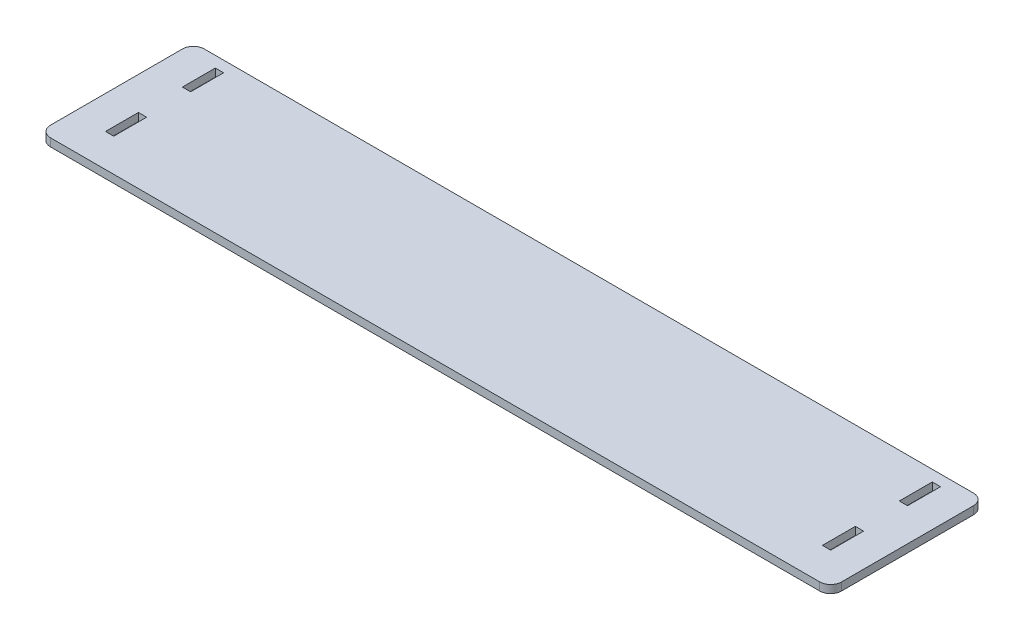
ISO-10303-21;
HEADER;
FILE_DESCRIPTION(('STEP AP214'),'2;1');
FILE_NAME('part.step','',(''),(''),'','','');
FILE_SCHEMA(('AUTOMOTIVE_DESIGN { 1 0 10303 214 1 1 1 1 }'));
ENDSEC;
DATA;
#1=APPLICATION_CONTEXT('core data for automotive mechanical design processes');
#2=APPLICATION_PROTOCOL_DEFINITION('international standard','automotive_design',2000,#1);
#3=PRODUCT_CONTEXT('',#1,'mechanical');
#4=PRODUCT('Part','Part','',(#3));
#5=PRODUCT_RELATED_PRODUCT_CATEGORY('part','',(#4));
#6=PRODUCT_DEFINITION_FORMATION('','',#4);
#7=PRODUCT_DEFINITION_CONTEXT('part definition',#1,'design');
#8=PRODUCT_DEFINITION('design','',#6,#7);
#9=PRODUCT_DEFINITION_SHAPE('','',#8);
#10=(LENGTH_UNIT() NAMED_UNIT(*) SI_UNIT(.MILLI.,.METRE.));
#11=(NAMED_UNIT(*) PLANE_ANGLE_UNIT() SI_UNIT($,.RADIAN.));
#12=(NAMED_UNIT(*) SI_UNIT($,.STERADIAN.) SOLID_ANGLE_UNIT());
#13=UNCERTAINTY_MEASURE_WITH_UNIT(LENGTH_MEASURE(1.E-05),#10,'distance_accuracy_value','');
#14=(GEOMETRIC_REPRESENTATION_CONTEXT(3) GLOBAL_UNCERTAINTY_ASSIGNED_CONTEXT((#13)) GLOBAL_UNIT_ASSIGNED_CONTEXT((#10,
#11,#12)) REPRESENTATION_CONTEXT('',''));
#15=CARTESIAN_POINT('',(0.,0.,0.));
#16=DIRECTION('',(0.,0.,1.));
#17=DIRECTION('',(1.,0.,0.));
#18=AXIS2_PLACEMENT_3D('',#15,#16,#17);
#19=CARTESIAN_POINT('',(0.,18.288,0.));
#20=DIRECTION('',(0.,1.,0.));
#21=DIRECTION('',(0.,0.,1.));
#22=AXIS2_PLACEMENT_3D('',#19,#20,#21);
#23=PLANE('',#22);
#24=DIRECTION('',(1.,0.,0.));
#25=VECTOR('',#24,1.);
#26=CARTESIAN_POINT('',(838.2,18.288,-152.4));
#27=LINE('',#26,#25);
#28=CARTESIAN_POINT('',(819.15,18.288,-152.4));
#29=VERTEX_POINT('',#28);
#30=CARTESIAN_POINT('',(838.2,18.288,-152.4));
#31=VERTEX_POINT('',#30);
#32=EDGE_CURVE('E240',#29,#31,#27,.T.);
#33=ORIENTED_EDGE('',*,*,#32,.T.);
#34=DIRECTION('',(0.,0.,1.));
#35=VECTOR('',#34,1.);
#36=CARTESIAN_POINT('',(838.2,18.288,-152.4));
#37=LINE('',#36,#35);
#38=CARTESIAN_POINT('',(838.2,18.288,-76.2000000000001));
#39=VERTEX_POINT('',#38);
#40=EDGE_CURVE('E223',#31,#39,#37,.T.);
#41=ORIENTED_EDGE('',*,*,#40,.T.);
#42=DIRECTION('',(-1.,0.,0.));
#43=VECTOR('',#42,1.);
#44=CARTESIAN_POINT('',(838.2,18.288,-76.2000000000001));
#45=LINE('',#44,#43);
#46=CARTESIAN_POINT('',(819.15,18.288,-76.2000000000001));
#47=VERTEX_POINT('',#46);
#48=EDGE_CURVE('E230',#39,#47,#45,.T.);
#49=ORIENTED_EDGE('',*,*,#48,.T.);
#50=DIRECTION('',(0.,0.,-1.));
#51=VECTOR('',#50,1.);
#52=CARTESIAN_POINT('',(819.15,18.288,-152.4));
#53=LINE('',#52,#51);
#54=EDGE_CURVE('E243',#47,#29,#53,.T.);
#55=ORIENTED_EDGE('',*,*,#54,.T.);
#56=EDGE_LOOP('',(#33,#41,#49,#55));
#57=FACE_BOUND('',#56,.T.);
#58=DIRECTION('',(0.,0.,1.));
#59=VECTOR('',#58,1.);
#60=CARTESIAN_POINT('',(-838.2,18.288,25.4000000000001));
#61=LINE('',#60,#59);
#62=CARTESIAN_POINT('',(-838.2,18.288,25.4000000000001));
#63=VERTEX_POINT('',#62);
#64=CARTESIAN_POINT('',(-838.2,18.288,101.6));
#65=VERTEX_POINT('',#64);
#66=EDGE_CURVE('E251',#63,#65,#61,.T.);
#67=ORIENTED_EDGE('',*,*,#66,.F.);
#68=DIRECTION('',(-1.,0.,0.));
#69=VECTOR('',#68,1.);
#70=CARTESIAN_POINT('',(-838.2,18.288,25.4000000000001));
#71=LINE('',#70,#69);
#72=CARTESIAN_POINT('',(-819.15,18.288,25.4000000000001));
#73=VERTEX_POINT('',#72);
#74=EDGE_CURVE('E262',#73,#63,#71,.T.);
#75=ORIENTED_EDGE('',*,*,#74,.F.);
#76=DIRECTION('',(0.,0.,-1.));
#77=VECTOR('',#76,1.);
#78=CARTESIAN_POINT('',(-819.15,18.288,25.4000000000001));
#79=LINE('',#78,#77);
#80=CARTESIAN_POINT('',(-819.15,18.288,101.6));
#81=VERTEX_POINT('',#80);
#82=EDGE_CURVE('E276',#81,#73,#79,.T.);
#83=ORIENTED_EDGE('',*,*,#82,.F.);
#84=DIRECTION('',(1.,0.,0.));
#85=VECTOR('',#84,1.);
#86=CARTESIAN_POINT('',(-838.2,18.288,101.6));
#87=LINE('',#86,#85);
#88=EDGE_CURVE('E273',#65,#81,#87,.T.);
#89=ORIENTED_EDGE('',*,*,#88,.F.);
#90=EDGE_LOOP('',(#67,#75,#83,#89));
#91=FACE_BOUND('',#90,.T.);
#92=DIRECTION('',(0.,0.,1.));
#93=VECTOR('',#92,1.);
#94=CARTESIAN_POINT('',(-838.2,18.288,-152.4));
#95=LINE('',#94,#93);
#96=CARTESIAN_POINT('',(-838.2,18.288,-152.4));
#97=VERTEX_POINT('',#96);
#98=CARTESIAN_POINT('',(-838.2,18.288,-76.2000000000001));
#99=VERTEX_POINT('',#98);
#100=EDGE_CURVE('E283',#97,#99,#95,.T.);
#101=ORIENTED_EDGE('',*,*,#100,.F.);
#102=DIRECTION('',(-1.,0.,0.));
#103=VECTOR('',#102,1.);
#104=CARTESIAN_POINT('',(-838.2,18.288,-152.4));
#105=LINE('',#104,#103);
#106=CARTESIAN_POINT('',(-819.15,18.288,-152.4));
#107=VERTEX_POINT('',#106);
#108=EDGE_CURVE('E294',#107,#97,#105,.T.);
#109=ORIENTED_EDGE('',*,*,#108,.F.);
#110=DIRECTION('',(0.,0.,-1.));
#111=VECTOR('',#110,1.);
#112=CARTESIAN_POINT('',(-819.15,18.288,-152.4));
#113=LINE('',#112,#111);
#114=CARTESIAN_POINT('',(-819.15,18.288,-76.2000000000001));
#115=VERTEX_POINT('',#114);
#116=EDGE_CURVE('E308',#115,#107,#113,.T.);
#117=ORIENTED_EDGE('',*,*,#116,.F.);
#118=DIRECTION('',(1.,0.,0.));
#119=VECTOR('',#118,1.);
#120=CARTESIAN_POINT('',(-838.2,18.288,-76.2000000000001));
#121=LINE('',#120,#119);
#122=EDGE_CURVE('E305',#99,#115,#121,.T.);
#123=ORIENTED_EDGE('',*,*,#122,.F.);
#124=EDGE_LOOP('',(#101,#109,#117,#123));
#125=FACE_BOUND('',#124,.T.);
#126=DIRECTION('',(-1.,0.,0.));
#127=VECTOR('',#126,1.);
#128=CARTESIAN_POINT('',(914.4,18.288,-177.8));
#129=LINE('',#128,#127);
#130=CARTESIAN_POINT('',(889.,18.288,-177.8));
#131=VERTEX_POINT('',#130);
#132=CARTESIAN_POINT('',(-889.,18.288,-177.8));
#133=VERTEX_POINT('',#132);
#134=EDGE_CURVE('E332',#131,#133,#129,.T.);
#135=ORIENTED_EDGE('',*,*,#134,.T.);
#136=CARTESIAN_POINT('',(-889.,18.288,-152.4));
#137=DIRECTION('',(0.,1.,0.));
#138=DIRECTION('',(0.,0.,1.));
#139=AXIS2_PLACEMENT_3D('',#136,#137,#138);
#140=CIRCLE('',#139,25.4);
#141=CARTESIAN_POINT('',(-914.4,18.288,-152.4));
#142=VERTEX_POINT('',#141);
#143=EDGE_CURVE('E369',#133,#142,#140,.T.);
#144=ORIENTED_EDGE('',*,*,#143,.T.);
#145=DIRECTION('',(0.,0.,1.));
#146=VECTOR('',#145,1.);
#147=CARTESIAN_POINT('',(-914.4,18.288,177.8));
#148=LINE('',#147,#146);
#149=CARTESIAN_POINT('',(-914.4,18.288,152.4));
#150=VERTEX_POINT('',#149);
#151=EDGE_CURVE('E322',#142,#150,#148,.T.);
#152=ORIENTED_EDGE('',*,*,#151,.T.);
#153=CARTESIAN_POINT('',(-889.,18.288,152.4));
#154=DIRECTION('',(0.,1.,0.));
#155=DIRECTION('',(0.,0.,1.));
#156=AXIS2_PLACEMENT_3D('',#153,#154,#155);
#157=CIRCLE('',#156,25.4);
#158=CARTESIAN_POINT('',(-889.,18.288,177.8));
#159=VERTEX_POINT('',#158);
#160=EDGE_CURVE('E367',#150,#159,#157,.T.);
#161=ORIENTED_EDGE('',*,*,#160,.T.);
#162=DIRECTION('',(1.,0.,0.));
#163=VECTOR('',#162,1.);
#164=CARTESIAN_POINT('',(914.4,18.288,177.8));
#165=LINE('',#164,#163);
#166=CARTESIAN_POINT('',(889.,18.288,177.8));
#167=VERTEX_POINT('',#166);
#168=EDGE_CURVE('E325',#159,#167,#165,.T.);
#169=ORIENTED_EDGE('',*,*,#168,.T.);
#170=CARTESIAN_POINT('',(889.,18.288,152.4));
#171=DIRECTION('',(0.,1.,0.));
#172=DIRECTION('',(0.,0.,1.));
#173=AXIS2_PLACEMENT_3D('',#170,#171,#172);
#174=CIRCLE('',#173,25.4);
#175=CARTESIAN_POINT('',(914.4,18.288,152.4));
#176=VERTEX_POINT('',#175);
#177=EDGE_CURVE('E363',#167,#176,#174,.T.);
#178=ORIENTED_EDGE('',*,*,#177,.T.);
#179=DIRECTION('',(0.,0.,-1.));
#180=VECTOR('',#179,1.);
#181=CARTESIAN_POINT('',(914.4,18.288,177.8));
#182=LINE('',#181,#180);
#183=CARTESIAN_POINT('',(914.4,18.288,-152.4));
#184=VERTEX_POINT('',#183);
#185=EDGE_CURVE('E329',#176,#184,#182,.T.);
#186=ORIENTED_EDGE('',*,*,#185,.T.);
#187=CARTESIAN_POINT('',(889.,18.288,-152.4));
#188=DIRECTION('',(0.,1.,0.));
#189=DIRECTION('',(0.,0.,1.));
#190=AXIS2_PLACEMENT_3D('',#187,#188,#189);
#191=CIRCLE('',#190,25.4);
#192=EDGE_CURVE('E365',#184,#131,#191,.T.);
#193=ORIENTED_EDGE('',*,*,#192,.T.);
#194=EDGE_LOOP('',(#135,#144,#152,#161,#169,#178,#186,#193));
#195=FACE_BOUND('',#194,.T.);
#196=DIRECTION('',(1.,0.,0.));
#197=VECTOR('',#196,1.);
#198=CARTESIAN_POINT('',(838.2,18.288,25.4000000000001));
#199=LINE('',#198,#197);
#200=CARTESIAN_POINT('',(819.15,18.288,25.4000000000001));
#201=VERTEX_POINT('',#200);
#202=CARTESIAN_POINT('',(838.2,18.288,25.4000000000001));
#203=VERTEX_POINT('',#202);
#204=EDGE_CURVE('E217',#201,#203,#199,.T.);
#205=ORIENTED_EDGE('',*,*,#204,.T.);
#206=DIRECTION('',(0.,0.,1.));
#207=VECTOR('',#206,1.);
#208=CARTESIAN_POINT('',(838.2,18.288,25.4000000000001));
#209=LINE('',#208,#207);
#210=CARTESIAN_POINT('',(838.2,18.288,101.6));
#211=VERTEX_POINT('',#210);
#212=EDGE_CURVE('E47',#203,#211,#209,.T.);
#213=ORIENTED_EDGE('',*,*,#212,.T.);
#214=DIRECTION('',(-1.,0.,0.));
#215=VECTOR('',#214,1.);
#216=CARTESIAN_POINT('',(838.2,18.288,101.6));
#217=LINE('',#216,#215);
#218=CARTESIAN_POINT('',(819.15,18.288,101.6));
#219=VERTEX_POINT('',#218);
#220=EDGE_CURVE('E208',#211,#219,#217,.T.);
#221=ORIENTED_EDGE('',*,*,#220,.T.);
#222=DIRECTION('',(0.,0.,-1.));
#223=VECTOR('',#222,1.);
#224=CARTESIAN_POINT('',(819.15,18.288,25.4000000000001));
#225=LINE('',#224,#223);
#226=EDGE_CURVE('E211',#219,#201,#225,.T.);
#227=ORIENTED_EDGE('',*,*,#226,.T.);
#228=EDGE_LOOP('',(#205,#213,#221,#227));
#229=FACE_BOUND('',#228,.T.);
#230=ADVANCED_FACE('F32',(#57,#91,#125,#195,#229),#23,.T.);
#231=CARTESIAN_POINT('',(0.,0.,0.));
#232=DIRECTION('',(0.,1.,0.));
#233=DIRECTION('',(0.,0.,1.));
#234=AXIS2_PLACEMENT_3D('',#231,#232,#233);
#235=PLANE('',#234);
#236=DIRECTION('',(0.,0.,1.));
#237=VECTOR('',#236,1.);
#238=CARTESIAN_POINT('',(838.2,0.,-152.4));
#239=LINE('',#238,#237);
#240=CARTESIAN_POINT('',(838.2,0.,-152.4));
#241=VERTEX_POINT('',#240);
#242=CARTESIAN_POINT('',(838.2,0.,-76.2000000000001));
#243=VERTEX_POINT('',#242);
#244=EDGE_CURVE('E227',#241,#243,#239,.T.);
#245=ORIENTED_EDGE('',*,*,#244,.F.);
#246=DIRECTION('',(1.,0.,0.));
#247=VECTOR('',#246,1.);
#248=CARTESIAN_POINT('',(838.2,0.,-152.4));
#249=LINE('',#248,#247);
#250=CARTESIAN_POINT('',(819.15,0.,-152.4));
#251=VERTEX_POINT('',#250);
#252=EDGE_CURVE('E229',#251,#241,#249,.T.);
#253=ORIENTED_EDGE('',*,*,#252,.F.);
#254=DIRECTION('',(0.,0.,-1.));
#255=VECTOR('',#254,1.);
#256=CARTESIAN_POINT('',(819.15,0.,-152.4));
#257=LINE('',#256,#255);
#258=CARTESIAN_POINT('',(819.15,0.,-76.2000000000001));
#259=VERTEX_POINT('',#258);
#260=EDGE_CURVE('E232',#259,#251,#257,.T.);
#261=ORIENTED_EDGE('',*,*,#260,.F.);
#262=DIRECTION('',(-1.,0.,0.));
#263=VECTOR('',#262,1.);
#264=CARTESIAN_POINT('',(838.2,0.,-76.2000000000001));
#265=LINE('',#264,#263);
#266=EDGE_CURVE('E235',#243,#259,#265,.T.);
#267=ORIENTED_EDGE('',*,*,#266,.F.);
#268=EDGE_LOOP('',(#245,#253,#261,#267));
#269=FACE_BOUND('',#268,.T.);
#270=DIRECTION('',(-1.,0.,0.));
#271=VECTOR('',#270,1.);
#272=CARTESIAN_POINT('',(-838.2,0.,25.4000000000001));
#273=LINE('',#272,#271);
#274=CARTESIAN_POINT('',(-819.15,0.,25.4000000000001));
#275=VERTEX_POINT('',#274);
#276=CARTESIAN_POINT('',(-838.2,0.,25.4000000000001));
#277=VERTEX_POINT('',#276);
#278=EDGE_CURVE('E268',#275,#277,#273,.T.);
#279=ORIENTED_EDGE('',*,*,#278,.T.);
#280=DIRECTION('',(0.,0.,1.));
#281=VECTOR('',#280,1.);
#282=CARTESIAN_POINT('',(-838.2,0.,25.4000000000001));
#283=LINE('',#282,#281);
#284=CARTESIAN_POINT('',(-838.2,0.,101.6));
#285=VERTEX_POINT('',#284);
#286=EDGE_CURVE('E258',#277,#285,#283,.T.);
#287=ORIENTED_EDGE('',*,*,#286,.T.);
#288=DIRECTION('',(1.,0.,0.));
#289=VECTOR('',#288,1.);
#290=CARTESIAN_POINT('',(-838.2,0.,101.6));
#291=LINE('',#290,#289);
#292=CARTESIAN_POINT('',(-819.15,0.,101.6));
#293=VERTEX_POINT('',#292);
#294=EDGE_CURVE('E261',#285,#293,#291,.T.);
#295=ORIENTED_EDGE('',*,*,#294,.T.);
#296=DIRECTION('',(0.,0.,-1.));
#297=VECTOR('',#296,1.);
#298=CARTESIAN_POINT('',(-819.15,0.,25.4000000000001));
#299=LINE('',#298,#297);
#300=EDGE_CURVE('E265',#293,#275,#299,.T.);
#301=ORIENTED_EDGE('',*,*,#300,.T.);
#302=EDGE_LOOP('',(#279,#287,#295,#301));
#303=FACE_BOUND('',#302,.T.);
#304=DIRECTION('',(-1.,0.,0.));
#305=VECTOR('',#304,1.);
#306=CARTESIAN_POINT('',(-838.2,0.,-152.4));
#307=LINE('',#306,#305);
#308=CARTESIAN_POINT('',(-819.15,0.,-152.4));
#309=VERTEX_POINT('',#308);
#310=CARTESIAN_POINT('',(-838.2,0.,-152.4));
#311=VERTEX_POINT('',#310);
#312=EDGE_CURVE('E300',#309,#311,#307,.T.);
#313=ORIENTED_EDGE('',*,*,#312,.T.);
#314=DIRECTION('',(0.,0.,1.));
#315=VECTOR('',#314,1.);
#316=CARTESIAN_POINT('',(-838.2,0.,-152.4));
#317=LINE('',#316,#315);
#318=CARTESIAN_POINT('',(-838.2,0.,-76.2000000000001));
#319=VERTEX_POINT('',#318);
#320=EDGE_CURVE('E290',#311,#319,#317,.T.);
#321=ORIENTED_EDGE('',*,*,#320,.T.);
#322=DIRECTION('',(1.,0.,0.));
#323=VECTOR('',#322,1.);
#324=CARTESIAN_POINT('',(-838.2,0.,-76.2000000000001));
#325=LINE('',#324,#323);
#326=CARTESIAN_POINT('',(-819.15,0.,-76.2000000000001));
#327=VERTEX_POINT('',#326);
#328=EDGE_CURVE('E293',#319,#327,#325,.T.);
#329=ORIENTED_EDGE('',*,*,#328,.T.);
#330=DIRECTION('',(0.,0.,-1.));
#331=VECTOR('',#330,1.);
#332=CARTESIAN_POINT('',(-819.15,0.,-152.4));
#333=LINE('',#332,#331);
#334=EDGE_CURVE('E297',#327,#309,#333,.T.);
#335=ORIENTED_EDGE('',*,*,#334,.T.);
#336=EDGE_LOOP('',(#313,#321,#329,#335));
#337=FACE_BOUND('',#336,.T.);
#338=DIRECTION('',(0.,0.,1.));
#339=VECTOR('',#338,1.);
#340=CARTESIAN_POINT('',(-914.4,0.,177.8));
#341=LINE('',#340,#339);
#342=CARTESIAN_POINT('',(-914.4,0.,-152.4));
#343=VERTEX_POINT('',#342);
#344=CARTESIAN_POINT('',(-914.4,0.,152.4));
#345=VERTEX_POINT('',#344);
#346=EDGE_CURVE('E315',#343,#345,#341,.T.);
#347=ORIENTED_EDGE('',*,*,#346,.F.);
#348=CARTESIAN_POINT('',(-889.,0.,-152.4));
#349=DIRECTION('',(0.,1.,0.));
#350=DIRECTION('',(0.,0.,1.));
#351=AXIS2_PLACEMENT_3D('',#348,#349,#350);
#352=CIRCLE('',#351,25.4);
#353=CARTESIAN_POINT('',(-889.,0.,-177.8));
#354=VERTEX_POINT('',#353);
#355=EDGE_CURVE('E356',#343,#354,#352,.F.);
#356=ORIENTED_EDGE('',*,*,#355,.T.);
#357=DIRECTION('',(-1.,0.,0.));
#358=VECTOR('',#357,1.);
#359=CARTESIAN_POINT('',(914.4,0.,-177.8));
#360=LINE('',#359,#358);
#361=CARTESIAN_POINT('',(889.,0.,-177.8));
#362=VERTEX_POINT('',#361);
#363=EDGE_CURVE('E326',#362,#354,#360,.T.);
#364=ORIENTED_EDGE('',*,*,#363,.F.);
#365=CARTESIAN_POINT('',(889.,0.,-152.4));
#366=DIRECTION('',(0.,1.,0.));
#367=DIRECTION('',(0.,0.,1.));
#368=AXIS2_PLACEMENT_3D('',#365,#366,#367);
#369=CIRCLE('',#368,25.4);
#370=CARTESIAN_POINT('',(914.4,0.,-152.4));
#371=VERTEX_POINT('',#370);
#372=EDGE_CURVE('E352',#362,#371,#369,.F.);
#373=ORIENTED_EDGE('',*,*,#372,.T.);
#374=DIRECTION('',(0.,0.,-1.));
#375=VECTOR('',#374,1.);
#376=CARTESIAN_POINT('',(914.4,0.,177.8));
#377=LINE('',#376,#375);
#378=CARTESIAN_POINT('',(914.4,0.,152.4));
#379=VERTEX_POINT('',#378);
#380=EDGE_CURVE('E341',#379,#371,#377,.T.);
#381=ORIENTED_EDGE('',*,*,#380,.F.);
#382=CARTESIAN_POINT('',(889.,0.,152.4));
#383=DIRECTION('',(0.,1.,0.));
#384=DIRECTION('',(0.,0.,1.));
#385=AXIS2_PLACEMENT_3D('',#382,#383,#384);
#386=CIRCLE('',#385,25.4);
#387=CARTESIAN_POINT('',(889.,0.,177.8));
#388=VERTEX_POINT('',#387);
#389=EDGE_CURVE('E350',#379,#388,#386,.F.);
#390=ORIENTED_EDGE('',*,*,#389,.T.);
#391=DIRECTION('',(1.,0.,0.));
#392=VECTOR('',#391,1.);
#393=CARTESIAN_POINT('',(914.4,0.,177.8));
#394=LINE('',#393,#392);
#395=CARTESIAN_POINT('',(-889.,0.,177.8));
#396=VERTEX_POINT('',#395);
#397=EDGE_CURVE('E338',#396,#388,#394,.T.);
#398=ORIENTED_EDGE('',*,*,#397,.F.);
#399=CARTESIAN_POINT('',(-889.,0.,152.4));
#400=DIRECTION('',(0.,1.,0.));
#401=DIRECTION('',(0.,0.,1.));
#402=AXIS2_PLACEMENT_3D('',#399,#400,#401);
#403=CIRCLE('',#402,25.4);
#404=EDGE_CURVE('E354',#396,#345,#403,.F.);
#405=ORIENTED_EDGE('',*,*,#404,.T.);
#406=EDGE_LOOP('',(#347,#356,#364,#373,#381,#390,#398,#405));
#407=FACE_BOUND('',#406,.T.);
#408=DIRECTION('',(0.,0.,1.));
#409=VECTOR('',#408,1.);
#410=CARTESIAN_POINT('',(838.2,0.,25.4000000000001));
#411=LINE('',#410,#409);
#412=CARTESIAN_POINT('',(838.2,0.,25.4000000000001));
#413=VERTEX_POINT('',#412);
#414=CARTESIAN_POINT('',(838.2,0.,101.6));
#415=VERTEX_POINT('',#414);
#416=EDGE_CURVE('E200',#413,#415,#411,.T.);
#417=ORIENTED_EDGE('',*,*,#416,.F.);
#418=DIRECTION('',(1.,0.,0.));
#419=VECTOR('',#418,1.);
#420=CARTESIAN_POINT('',(838.2,0.,25.4000000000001));
#421=LINE('',#420,#419);
#422=CARTESIAN_POINT('',(819.15,0.,25.4000000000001));
#423=VERTEX_POINT('',#422);
#424=EDGE_CURVE('E192',#423,#413,#421,.T.);
#425=ORIENTED_EDGE('',*,*,#424,.F.);
#426=DIRECTION('',(0.,0.,-1.));
#427=VECTOR('',#426,1.);
#428=CARTESIAN_POINT('',(819.15,0.,25.4000000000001));
#429=LINE('',#428,#427);
#430=CARTESIAN_POINT('',(819.15,0.,101.6));
#431=VERTEX_POINT('',#430);
#432=EDGE_CURVE('E199',#431,#423,#429,.T.);
#433=ORIENTED_EDGE('',*,*,#432,.F.);
#434=DIRECTION('',(-1.,0.,0.));
#435=VECTOR('',#434,1.);
#436=CARTESIAN_POINT('',(838.2,0.,101.6));
#437=LINE('',#436,#435);
#438=EDGE_CURVE('E204',#415,#431,#437,.T.);
#439=ORIENTED_EDGE('',*,*,#438,.F.);
#440=EDGE_LOOP('',(#417,#425,#433,#439));
#441=FACE_BOUND('',#440,.T.);
#442=ADVANCED_FACE('F207',(#269,#303,#337,#407,#441),#235,.F.);
#443=CARTESIAN_POINT('',(-914.4,18.288,177.8));
#444=DIRECTION('',(1.,0.,0.));
#445=DIRECTION('',(0.,0.,-1.));
#446=AXIS2_PLACEMENT_3D('',#443,#444,#445);
#447=PLANE('',#446);
#448=ORIENTED_EDGE('',*,*,#151,.F.);
#449=DIRECTION('',(0.,-1.,0.));
#450=VECTOR('',#449,1.);
#451=CARTESIAN_POINT('',(-914.4,18.288,-152.4));
#452=LINE('',#451,#450);
#453=EDGE_CURVE('E347',#142,#343,#452,.T.);
#454=ORIENTED_EDGE('',*,*,#453,.T.);
#455=ORIENTED_EDGE('',*,*,#346,.T.);
#456=DIRECTION('',(0.,-1.,0.));
#457=VECTOR('',#456,1.);
#458=CARTESIAN_POINT('',(-914.4,18.288,152.4));
#459=LINE('',#458,#457);
#460=EDGE_CURVE('E335',#345,#150,#459,.F.);
#461=ORIENTED_EDGE('',*,*,#460,.T.);
#462=EDGE_LOOP('',(#448,#454,#455,#461));
#463=FACE_BOUND('',#462,.T.);
#464=ADVANCED_FACE('F404',(#463),#447,.F.);
#465=CARTESIAN_POINT('',(914.4,18.288,177.8));
#466=DIRECTION('',(0.,0.,-1.));
#467=DIRECTION('',(-1.,0.,0.));
#468=AXIS2_PLACEMENT_3D('',#465,#466,#467);
#469=PLANE('',#468);
#470=ORIENTED_EDGE('',*,*,#168,.F.);
#471=DIRECTION('',(0.,-1.,0.));
#472=VECTOR('',#471,1.);
#473=CARTESIAN_POINT('',(-889.,18.288,177.8));
#474=LINE('',#473,#472);
#475=EDGE_CURVE('E373',#159,#396,#474,.T.);
#476=ORIENTED_EDGE('',*,*,#475,.T.);
#477=ORIENTED_EDGE('',*,*,#397,.T.);
#478=DIRECTION('',(0.,-1.,0.));
#479=VECTOR('',#478,1.);
#480=CARTESIAN_POINT('',(889.,18.288,177.8));
#481=LINE('',#480,#479);
#482=EDGE_CURVE('E371',#388,#167,#481,.F.);
#483=ORIENTED_EDGE('',*,*,#482,.T.);
#484=EDGE_LOOP('',(#470,#476,#477,#483));
#485=FACE_BOUND('',#484,.T.);
#486=ADVANCED_FACE('F412',(#485),#469,.F.);
#487=CARTESIAN_POINT('',(914.4,18.288,177.8));
#488=DIRECTION('',(-1.,0.,0.));
#489=DIRECTION('',(0.,0.,1.));
#490=AXIS2_PLACEMENT_3D('',#487,#488,#489);
#491=PLANE('',#490);
#492=ORIENTED_EDGE('',*,*,#380,.T.);
#493=DIRECTION('',(0.,-1.,0.));
#494=VECTOR('',#493,1.);
#495=CARTESIAN_POINT('',(914.4,18.288,-152.4));
#496=LINE('',#495,#494);
#497=EDGE_CURVE('E11',#371,#184,#496,.F.);
#498=ORIENTED_EDGE('',*,*,#497,.T.);
#499=ORIENTED_EDGE('',*,*,#185,.F.);
#500=DIRECTION('',(0.,-1.,0.));
#501=VECTOR('',#500,1.);
#502=CARTESIAN_POINT('',(914.4,18.288,152.4));
#503=LINE('',#502,#501);
#504=EDGE_CURVE('E40',#176,#379,#503,.T.);
#505=ORIENTED_EDGE('',*,*,#504,.T.);
#506=EDGE_LOOP('',(#492,#498,#499,#505));
#507=FACE_BOUND('',#506,.T.);
#508=ADVANCED_FACE('F380',(#507),#491,.F.);
#509=CARTESIAN_POINT('',(914.4,18.288,-177.8));
#510=DIRECTION('',(0.,0.,1.));
#511=DIRECTION('',(1.,0.,0.));
#512=AXIS2_PLACEMENT_3D('',#509,#510,#511);
#513=PLANE('',#512);
#514=ORIENTED_EDGE('',*,*,#363,.T.);
#515=DIRECTION('',(0.,-1.,0.));
#516=VECTOR('',#515,1.);
#517=CARTESIAN_POINT('',(-889.,18.288,-177.8));
#518=LINE('',#517,#516);
#519=EDGE_CURVE('E361',#354,#133,#518,.F.);
#520=ORIENTED_EDGE('',*,*,#519,.T.);
#521=ORIENTED_EDGE('',*,*,#134,.F.);
#522=DIRECTION('',(0.,-1.,0.));
#523=VECTOR('',#522,1.);
#524=CARTESIAN_POINT('',(889.,18.288,-177.8));
#525=LINE('',#524,#523);
#526=EDGE_CURVE('E358',#131,#362,#525,.T.);
#527=ORIENTED_EDGE('',*,*,#526,.T.);
#528=EDGE_LOOP('',(#514,#520,#521,#527));
#529=FACE_BOUND('',#528,.T.);
#530=ADVANCED_FACE('F394',(#529),#513,.F.);
#531=CARTESIAN_POINT('',(-889.,18.288,-152.4));
#532=DIRECTION('',(0.,-1.,0.));
#533=DIRECTION('',(0.,0.,-1.));
#534=AXIS2_PLACEMENT_3D('',#531,#532,#533);
#535=CYLINDRICAL_SURFACE('',#534,25.4);
#536=ORIENTED_EDGE('',*,*,#143,.F.);
#537=ORIENTED_EDGE('',*,*,#519,.F.);
#538=ORIENTED_EDGE('',*,*,#355,.F.);
#539=ORIENTED_EDGE('',*,*,#453,.F.);
#540=EDGE_LOOP('',(#536,#537,#538,#539));
#541=FACE_BOUND('',#540,.T.);
#542=ADVANCED_FACE('F402',(#541),#535,.T.);
#543=CARTESIAN_POINT('',(-889.,18.288,152.4));
#544=DIRECTION('',(0.,-1.,0.));
#545=DIRECTION('',(0.,0.,-1.));
#546=AXIS2_PLACEMENT_3D('',#543,#544,#545);
#547=CYLINDRICAL_SURFACE('',#546,25.4);
#548=ORIENTED_EDGE('',*,*,#160,.F.);
#549=ORIENTED_EDGE('',*,*,#460,.F.);
#550=ORIENTED_EDGE('',*,*,#404,.F.);
#551=ORIENTED_EDGE('',*,*,#475,.F.);
#552=EDGE_LOOP('',(#548,#549,#550,#551));
#553=FACE_BOUND('',#552,.T.);
#554=ADVANCED_FACE('F409',(#553),#547,.T.);
#555=CARTESIAN_POINT('',(889.,18.288,-152.4));
#556=DIRECTION('',(0.,-1.,0.));
#557=DIRECTION('',(0.,0.,-1.));
#558=AXIS2_PLACEMENT_3D('',#555,#556,#557);
#559=CYLINDRICAL_SURFACE('',#558,25.4);
#560=ORIENTED_EDGE('',*,*,#192,.F.);
#561=ORIENTED_EDGE('',*,*,#497,.F.);
#562=ORIENTED_EDGE('',*,*,#372,.F.);
#563=ORIENTED_EDGE('',*,*,#526,.F.);
#564=EDGE_LOOP('',(#560,#561,#562,#563));
#565=FACE_BOUND('',#564,.T.);
#566=ADVANCED_FACE('F391',(#565),#559,.T.);
#567=CARTESIAN_POINT('',(889.,18.288,152.4));
#568=DIRECTION('',(0.,-1.,0.));
#569=DIRECTION('',(0.,0.,-1.));
#570=AXIS2_PLACEMENT_3D('',#567,#568,#569);
#571=CYLINDRICAL_SURFACE('',#570,25.4);
#572=ORIENTED_EDGE('',*,*,#177,.F.);
#573=ORIENTED_EDGE('',*,*,#482,.F.);
#574=ORIENTED_EDGE('',*,*,#389,.F.);
#575=ORIENTED_EDGE('',*,*,#504,.F.);
#576=EDGE_LOOP('',(#572,#573,#574,#575));
#577=FACE_BOUND('',#576,.T.);
#578=ADVANCED_FACE('F34',(#577),#571,.T.);
#579=CARTESIAN_POINT('',(-838.2,0.,-152.4));
#580=DIRECTION('',(-1.,0.,0.));
#581=DIRECTION('',(0.,0.,1.));
#582=AXIS2_PLACEMENT_3D('',#579,#580,#581);
#583=PLANE('',#582);
#584=ORIENTED_EDGE('',*,*,#100,.T.);
#585=DIRECTION('',(0.,1.,0.));
#586=VECTOR('',#585,1.);
#587=CARTESIAN_POINT('',(-838.2,0.,-76.2000000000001));
#588=LINE('',#587,#586);
#589=EDGE_CURVE('E303',#319,#99,#588,.T.);
#590=ORIENTED_EDGE('',*,*,#589,.F.);
#591=ORIENTED_EDGE('',*,*,#320,.F.);
#592=DIRECTION('',(0.,1.,0.));
#593=VECTOR('',#592,1.);
#594=CARTESIAN_POINT('',(-838.2,0.,-152.4));
#595=LINE('',#594,#593);
#596=EDGE_CURVE('E313',#311,#97,#595,.T.);
#597=ORIENTED_EDGE('',*,*,#596,.T.);
#598=EDGE_LOOP('',(#584,#590,#591,#597));
#599=FACE_BOUND('',#598,.T.);
#600=ADVANCED_FACE('F415',(#599),#583,.F.);
#601=CARTESIAN_POINT('',(-838.2,0.,-152.4));
#602=DIRECTION('',(0.,0.,-1.));
#603=DIRECTION('',(-1.,0.,0.));
#604=AXIS2_PLACEMENT_3D('',#601,#602,#603);
#605=PLANE('',#604);
#606=ORIENTED_EDGE('',*,*,#108,.T.);
#607=ORIENTED_EDGE('',*,*,#596,.F.);
#608=ORIENTED_EDGE('',*,*,#312,.F.);
#609=DIRECTION('',(0.,1.,0.));
#610=VECTOR('',#609,1.);
#611=CARTESIAN_POINT('',(-819.15,0.,-152.4));
#612=LINE('',#611,#610);
#613=EDGE_CURVE('E316',#309,#107,#612,.T.);
#614=ORIENTED_EDGE('',*,*,#613,.T.);
#615=EDGE_LOOP('',(#606,#607,#608,#614));
#616=FACE_BOUND('',#615,.T.);
#617=ADVANCED_FACE('F420',(#616),#605,.F.);
#618=CARTESIAN_POINT('',(-819.15,0.,-152.4));
#619=DIRECTION('',(1.,0.,0.));
#620=DIRECTION('',(0.,0.,-1.));
#621=AXIS2_PLACEMENT_3D('',#618,#619,#620);
#622=PLANE('',#621);
#623=ORIENTED_EDGE('',*,*,#116,.T.);
#624=ORIENTED_EDGE('',*,*,#613,.F.);
#625=ORIENTED_EDGE('',*,*,#334,.F.);
#626=DIRECTION('',(0.,1.,0.));
#627=VECTOR('',#626,1.);
#628=CARTESIAN_POINT('',(-819.15,0.,-76.2000000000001));
#629=LINE('',#628,#627);
#630=EDGE_CURVE('E318',#327,#115,#629,.T.);
#631=ORIENTED_EDGE('',*,*,#630,.T.);
#632=EDGE_LOOP('',(#623,#624,#625,#631));
#633=FACE_BOUND('',#632,.T.);
#634=ADVANCED_FACE('F472',(#633),#622,.F.);
#635=CARTESIAN_POINT('',(-838.2,0.,-76.2000000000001));
#636=DIRECTION('',(0.,0.,1.));
#637=DIRECTION('',(1.,0.,0.));
#638=AXIS2_PLACEMENT_3D('',#635,#636,#637);
#639=PLANE('',#638);
#640=ORIENTED_EDGE('',*,*,#122,.T.);
#641=ORIENTED_EDGE('',*,*,#630,.F.);
#642=ORIENTED_EDGE('',*,*,#328,.F.);
#643=ORIENTED_EDGE('',*,*,#589,.T.);
#644=EDGE_LOOP('',(#640,#641,#642,#643));
#645=FACE_BOUND('',#644,.T.);
#646=ADVANCED_FACE('F482',(#645),#639,.F.);
#647=CARTESIAN_POINT('',(-838.2,0.,25.4000000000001));
#648=DIRECTION('',(-1.,0.,0.));
#649=DIRECTION('',(0.,0.,1.));
#650=AXIS2_PLACEMENT_3D('',#647,#648,#649);
#651=PLANE('',#650);
#652=ORIENTED_EDGE('',*,*,#66,.T.);
#653=DIRECTION('',(0.,1.,0.));
#654=VECTOR('',#653,1.);
#655=CARTESIAN_POINT('',(-838.2,0.,101.6));
#656=LINE('',#655,#654);
#657=EDGE_CURVE('E271',#285,#65,#656,.T.);
#658=ORIENTED_EDGE('',*,*,#657,.F.);
#659=ORIENTED_EDGE('',*,*,#286,.F.);
#660=DIRECTION('',(0.,1.,0.));
#661=VECTOR('',#660,1.);
#662=CARTESIAN_POINT('',(-838.2,0.,25.4000000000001));
#663=LINE('',#662,#661);
#664=EDGE_CURVE('E281',#277,#63,#663,.T.);
#665=ORIENTED_EDGE('',*,*,#664,.T.);
#666=EDGE_LOOP('',(#652,#658,#659,#665));
#667=FACE_BOUND('',#666,.T.);
#668=ADVANCED_FACE('F492',(#667),#651,.F.);
#669=CARTESIAN_POINT('',(-838.2,0.,25.4000000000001));
#670=DIRECTION('',(0.,0.,-1.));
#671=DIRECTION('',(-1.,0.,0.));
#672=AXIS2_PLACEMENT_3D('',#669,#670,#671);
#673=PLANE('',#672);
#674=ORIENTED_EDGE('',*,*,#74,.T.);
#675=ORIENTED_EDGE('',*,*,#664,.F.);
#676=ORIENTED_EDGE('',*,*,#278,.F.);
#677=DIRECTION('',(0.,1.,0.));
#678=VECTOR('',#677,1.);
#679=CARTESIAN_POINT('',(-819.15,0.,25.4000000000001));
#680=LINE('',#679,#678);
#681=EDGE_CURVE('E284',#275,#73,#680,.T.);
#682=ORIENTED_EDGE('',*,*,#681,.T.);
#683=EDGE_LOOP('',(#674,#675,#676,#682));
#684=FACE_BOUND('',#683,.T.);
#685=ADVANCED_FACE('F501',(#684),#673,.F.);
#686=CARTESIAN_POINT('',(-819.15,0.,25.4000000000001));
#687=DIRECTION('',(1.,0.,0.));
#688=DIRECTION('',(0.,0.,-1.));
#689=AXIS2_PLACEMENT_3D('',#686,#687,#688);
#690=PLANE('',#689);
#691=ORIENTED_EDGE('',*,*,#82,.T.);
#692=ORIENTED_EDGE('',*,*,#681,.F.);
#693=ORIENTED_EDGE('',*,*,#300,.F.);
#694=DIRECTION('',(0.,1.,0.));
#695=VECTOR('',#694,1.);
#696=CARTESIAN_POINT('',(-819.15,0.,101.6));
#697=LINE('',#696,#695);
#698=EDGE_CURVE('E286',#293,#81,#697,.T.);
#699=ORIENTED_EDGE('',*,*,#698,.T.);
#700=EDGE_LOOP('',(#691,#692,#693,#699));
#701=FACE_BOUND('',#700,.T.);
#702=ADVANCED_FACE('F511',(#701),#690,.F.);
#703=CARTESIAN_POINT('',(-838.2,0.,101.6));
#704=DIRECTION('',(0.,0.,1.));
#705=DIRECTION('',(1.,0.,0.));
#706=AXIS2_PLACEMENT_3D('',#703,#704,#705);
#707=PLANE('',#706);
#708=ORIENTED_EDGE('',*,*,#88,.T.);
#709=ORIENTED_EDGE('',*,*,#698,.F.);
#710=ORIENTED_EDGE('',*,*,#294,.F.);
#711=ORIENTED_EDGE('',*,*,#657,.T.);
#712=EDGE_LOOP('',(#708,#709,#710,#711));
#713=FACE_BOUND('',#712,.T.);
#714=ADVANCED_FACE('F521',(#713),#707,.F.);
#715=CARTESIAN_POINT('',(838.2,0.,-152.4));
#716=DIRECTION('',(-1.,0.,0.));
#717=DIRECTION('',(0.,0.,1.));
#718=AXIS2_PLACEMENT_3D('',#715,#716,#717);
#719=PLANE('',#718);
#720=ORIENTED_EDGE('',*,*,#40,.F.);
#721=DIRECTION('',(0.,1.,0.));
#722=VECTOR('',#721,1.);
#723=CARTESIAN_POINT('',(838.2,0.,-152.4));
#724=LINE('',#723,#722);
#725=EDGE_CURVE('E237',#241,#31,#724,.T.);
#726=ORIENTED_EDGE('',*,*,#725,.F.);
#727=ORIENTED_EDGE('',*,*,#244,.T.);
#728=DIRECTION('',(0.,1.,0.));
#729=VECTOR('',#728,1.);
#730=CARTESIAN_POINT('',(838.2,0.,-76.2000000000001));
#731=LINE('',#730,#729);
#732=EDGE_CURVE('E248',#243,#39,#731,.T.);
#733=ORIENTED_EDGE('',*,*,#732,.T.);
#734=EDGE_LOOP('',(#720,#726,#727,#733));
#735=FACE_BOUND('',#734,.T.);
#736=ADVANCED_FACE('F530',(#735),#719,.T.);
#737=CARTESIAN_POINT('',(838.2,0.,-76.2000000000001));
#738=DIRECTION('',(0.,0.,-1.));
#739=DIRECTION('',(-1.,0.,0.));
#740=AXIS2_PLACEMENT_3D('',#737,#738,#739);
#741=PLANE('',#740);
#742=ORIENTED_EDGE('',*,*,#48,.F.);
#743=ORIENTED_EDGE('',*,*,#732,.F.);
#744=ORIENTED_EDGE('',*,*,#266,.T.);
#745=DIRECTION('',(0.,1.,0.));
#746=VECTOR('',#745,1.);
#747=CARTESIAN_POINT('',(819.15,0.,-76.2000000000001));
#748=LINE('',#747,#746);
#749=EDGE_CURVE('E252',#259,#47,#748,.T.);
#750=ORIENTED_EDGE('',*,*,#749,.T.);
#751=EDGE_LOOP('',(#742,#743,#744,#750));
#752=FACE_BOUND('',#751,.T.);
#753=ADVANCED_FACE('F551',(#752),#741,.T.);
#754=CARTESIAN_POINT('',(819.15,0.,-152.4));
#755=DIRECTION('',(1.,0.,0.));
#756=DIRECTION('',(0.,0.,-1.));
#757=AXIS2_PLACEMENT_3D('',#754,#755,#756);
#758=PLANE('',#757);
#759=ORIENTED_EDGE('',*,*,#54,.F.);
#760=ORIENTED_EDGE('',*,*,#749,.F.);
#761=ORIENTED_EDGE('',*,*,#260,.T.);
#762=DIRECTION('',(0.,1.,0.));
#763=VECTOR('',#762,1.);
#764=CARTESIAN_POINT('',(819.15,0.,-152.4));
#765=LINE('',#764,#763);
#766=EDGE_CURVE('E254',#251,#29,#765,.T.);
#767=ORIENTED_EDGE('',*,*,#766,.T.);
#768=EDGE_LOOP('',(#759,#760,#761,#767));
#769=FACE_BOUND('',#768,.T.);
#770=ADVANCED_FACE('F561',(#769),#758,.T.);
#771=CARTESIAN_POINT('',(838.2,0.,-152.4));
#772=DIRECTION('',(0.,0.,1.));
#773=DIRECTION('',(1.,0.,0.));
#774=AXIS2_PLACEMENT_3D('',#771,#772,#773);
#775=PLANE('',#774);
#776=ORIENTED_EDGE('',*,*,#32,.F.);
#777=ORIENTED_EDGE('',*,*,#766,.F.);
#778=ORIENTED_EDGE('',*,*,#252,.T.);
#779=ORIENTED_EDGE('',*,*,#725,.T.);
#780=EDGE_LOOP('',(#776,#777,#778,#779));
#781=FACE_BOUND('',#780,.T.);
#782=ADVANCED_FACE('F571',(#781),#775,.T.);
#783=CARTESIAN_POINT('',(838.2,0.,25.4000000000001));
#784=DIRECTION('',(-1.,0.,0.));
#785=DIRECTION('',(0.,0.,1.));
#786=AXIS2_PLACEMENT_3D('',#783,#784,#785);
#787=PLANE('',#786);
#788=ORIENTED_EDGE('',*,*,#212,.F.);
#789=DIRECTION('',(0.,1.,0.));
#790=VECTOR('',#789,1.);
#791=CARTESIAN_POINT('',(838.2,0.,25.4000000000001));
#792=LINE('',#791,#790);
#793=EDGE_CURVE('E194',#413,#203,#792,.T.);
#794=ORIENTED_EDGE('',*,*,#793,.F.);
#795=ORIENTED_EDGE('',*,*,#416,.T.);
#796=DIRECTION('',(0.,1.,0.));
#797=VECTOR('',#796,1.);
#798=CARTESIAN_POINT('',(838.2,0.,101.6));
#799=LINE('',#798,#797);
#800=EDGE_CURVE('E221',#415,#211,#799,.T.);
#801=ORIENTED_EDGE('',*,*,#800,.T.);
#802=EDGE_LOOP('',(#788,#794,#795,#801));
#803=FACE_BOUND('',#802,.T.);
#804=ADVANCED_FACE('F202',(#803),#787,.T.);
#805=CARTESIAN_POINT('',(838.2,0.,101.6));
#806=DIRECTION('',(0.,0.,-1.));
#807=DIRECTION('',(-1.,0.,0.));
#808=AXIS2_PLACEMENT_3D('',#805,#806,#807);
#809=PLANE('',#808);
#810=ORIENTED_EDGE('',*,*,#220,.F.);
#811=ORIENTED_EDGE('',*,*,#800,.F.);
#812=ORIENTED_EDGE('',*,*,#438,.T.);
#813=DIRECTION('',(0.,1.,0.));
#814=VECTOR('',#813,1.);
#815=CARTESIAN_POINT('',(819.15,0.,101.6));
#816=LINE('',#815,#814);
#817=EDGE_CURVE('E224',#431,#219,#816,.T.);
#818=ORIENTED_EDGE('',*,*,#817,.T.);
#819=EDGE_LOOP('',(#810,#811,#812,#818));
#820=FACE_BOUND('',#819,.T.);
#821=ADVANCED_FACE('F590',(#820),#809,.T.);
#822=CARTESIAN_POINT('',(819.15,0.,25.4000000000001));
#823=DIRECTION('',(1.,0.,0.));
#824=DIRECTION('',(0.,0.,-1.));
#825=AXIS2_PLACEMENT_3D('',#822,#823,#824);
#826=PLANE('',#825);
#827=ORIENTED_EDGE('',*,*,#226,.F.);
#828=ORIENTED_EDGE('',*,*,#817,.F.);
#829=ORIENTED_EDGE('',*,*,#432,.T.);
#830=DIRECTION('',(0.,1.,0.));
#831=VECTOR('',#830,1.);
#832=CARTESIAN_POINT('',(819.15,0.,25.4000000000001));
#833=LINE('',#832,#831);
#834=EDGE_CURVE('E55',#423,#201,#833,.T.);
#835=ORIENTED_EDGE('',*,*,#834,.T.);
#836=EDGE_LOOP('',(#827,#828,#829,#835));
#837=FACE_BOUND('',#836,.T.);
#838=ADVANCED_FACE('F599',(#837),#826,.T.);
#839=CARTESIAN_POINT('',(838.2,0.,25.4000000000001));
#840=DIRECTION('',(0.,0.,1.));
#841=DIRECTION('',(1.,0.,0.));
#842=AXIS2_PLACEMENT_3D('',#839,#840,#841);
#843=PLANE('',#842);
#844=ORIENTED_EDGE('',*,*,#204,.F.);
#845=ORIENTED_EDGE('',*,*,#834,.F.);
#846=ORIENTED_EDGE('',*,*,#424,.T.);
#847=ORIENTED_EDGE('',*,*,#793,.T.);
#848=EDGE_LOOP('',(#844,#845,#846,#847));
#849=FACE_BOUND('',#848,.T.);
#850=ADVANCED_FACE('F193',(#849),#843,.T.);
#851=CLOSED_SHELL('',(#230,#442,#464,#486,#508,#530,#542,#554,#566,#578,#600,#617,#634,#646,
#668,#685,#702,#714,#736,#753,#770,#782,#804,#821,#838,#850));
#852=MANIFOLD_SOLID_BREP('B2',#851);
#853=ADVANCED_BREP_SHAPE_REPRESENTATION('',(#18,#852),#14);
#854=SHAPE_DEFINITION_REPRESENTATION(#9,#853);
ENDSEC;
END-ISO-10303-21;
